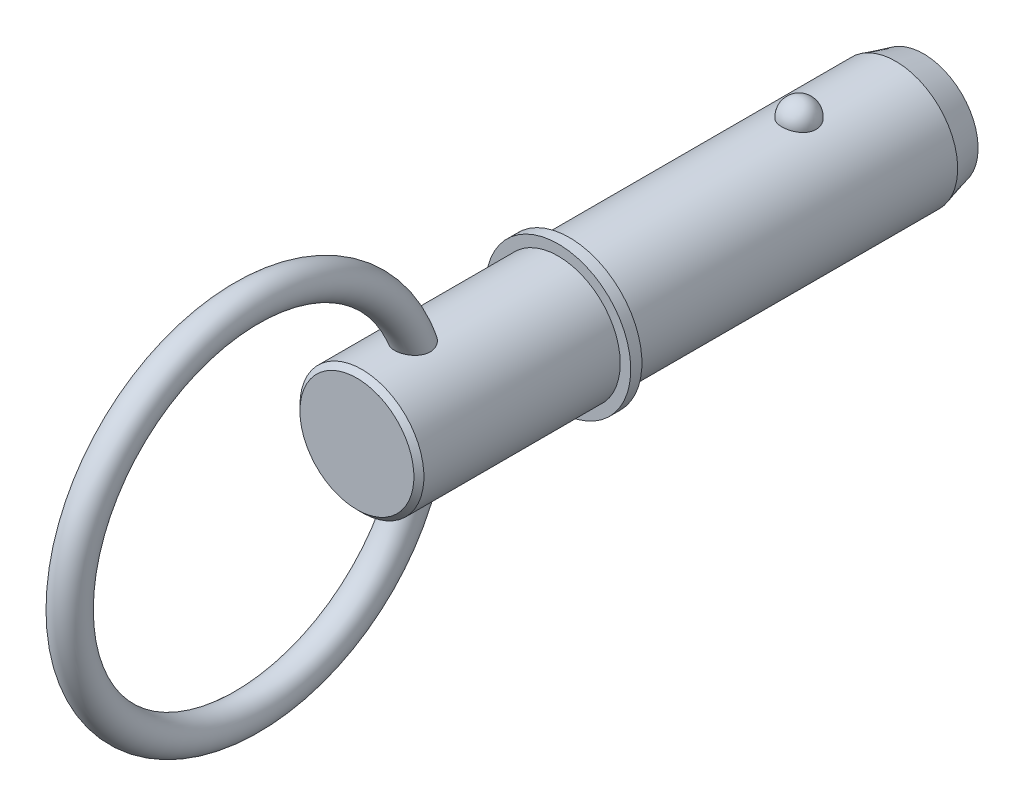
from build123d import *

# Parameters (mm, degrees)
SKETCH2_R           = 11.115
BOSS_EXTRUDE1_DEPTH = 38.1
BOSS_EXTRUDE2_START = 25.4
SKETCH3_R           = 11.115
BOSS_EXTRUDE2_DEPTH = 25.4
CHAMFER1_SIZE       = 5
CHAMFER1_SIZE2      = 1.339745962
SKETCH20_W          = 2
SKETCH20_H          = 13
SKETCH21_R          = 11.115
BOSS_EXTRUDE3_DEPTH = 38.1
CHAMFER2_SIZE       = 0.9
SKETCH24_R          = 3


with BuildPart() as part:
    # Sketch2 → Boss-Extrude1 (new body)
    with BuildSketch(Plane.XY):
        with Locations(Location((0, 0, 0), (0, 0, 180))):
            Circle(SKETCH2_R)
    extrude(amount=BOSS_EXTRUDE1_DEPTH)

    # Sketch3 → Boss-Extrude2 (add)
    with BuildSketch(Plane(origin=(0, 0, 0), x_dir=(-1, 0, 0), z_dir=(0, 0, -1)).offset(BOSS_EXTRUDE2_START)):
        Circle(SKETCH3_R)
    extrude(amount=-BOSS_EXTRUDE2_DEPTH)

    # Chamfer1
    chamfer1_edges = [part.edges().sort_by_distance(p)[0] for p in [
        (11.115, 0, -25.4),
    ]]
    chamfer1_side = [part.faces().sort_by_distance(p)[0] for p in [
        (11.115, 0, 6.35),
    ]]
    chamfer(chamfer1_edges, length=CHAMFER1_SIZE, length2=CHAMFER1_SIZE2, reference=chamfer1_side[0])

    # Sketch18 → Revolve1 (revolve)
    with BuildSketch(Plane(origin=(0, 0, 0), x_dir=(0, 0, -1), z_dir=(1, 0, 0))):
        with BuildLine():
            Line((3.07, 14.185), (3.07, 8.045))
            ThreePointArc((3.07, 8.045), (0, 11.115), (3.07, 14.185))
        make_face()
    revolve(axis=Axis((0, 14.185, -3.07), (0, -1, 0)))

    # Sketch20 → Revolve2 (revolve)
    with BuildSketch(Plane(origin=(0, 0, 0), x_dir=(0, 0, -1), z_dir=(1, 0, 0)), mode=Mode.PRIVATE) as revolve2_sk:
        with Locations((-39.1, 6.5)):
            Rectangle(SKETCH20_W, SKETCH20_H)
    revolve(revolve2_sk.sketch.rotate(Axis((0, 0, 33.728787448), (0, 0, 1)), 90), axis=Axis((0, 0, 33.728787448), (0, 0, 1)))

    # Sketch21 → Boss-Extrude3 (add)
    with BuildSketch(Plane(origin=(0, 0, 38.1), x_dir=(-1, 0, 0), z_dir=(0, 0, -1))):
        Circle(SKETCH21_R)
    extrude(amount=-BOSS_EXTRUDE3_DEPTH)

    # Chamfer2
    chamfer2_edges = [part.edges().sort_by_distance(p)[0] for p in [
        (11.115, 0, 76.2),
    ]]
    chamfer(chamfer2_edges, length=CHAMFER2_SIZE)

    # Sweep1: sweep along a path in Sketch23
    with BuildLine(Plane(origin=(0, 0, 0), x_dir=(0, 0, -1), z_dir=(1, 0, 0))) as sweep1_path:
        CenterArc((-95.95, 0), 31.75, 0, 360)
    # Sketch24 → Sweep1 (sweep)
    with BuildSketch(Plane(origin=(0, 0, 0), x_dir=(1, 0, 0), z_dir=(0, 1, 0))):
        with Locations((0, -64.2)):
            Circle(SKETCH24_R)
    sweep(path=sweep1_path.line)


solid = part.part
